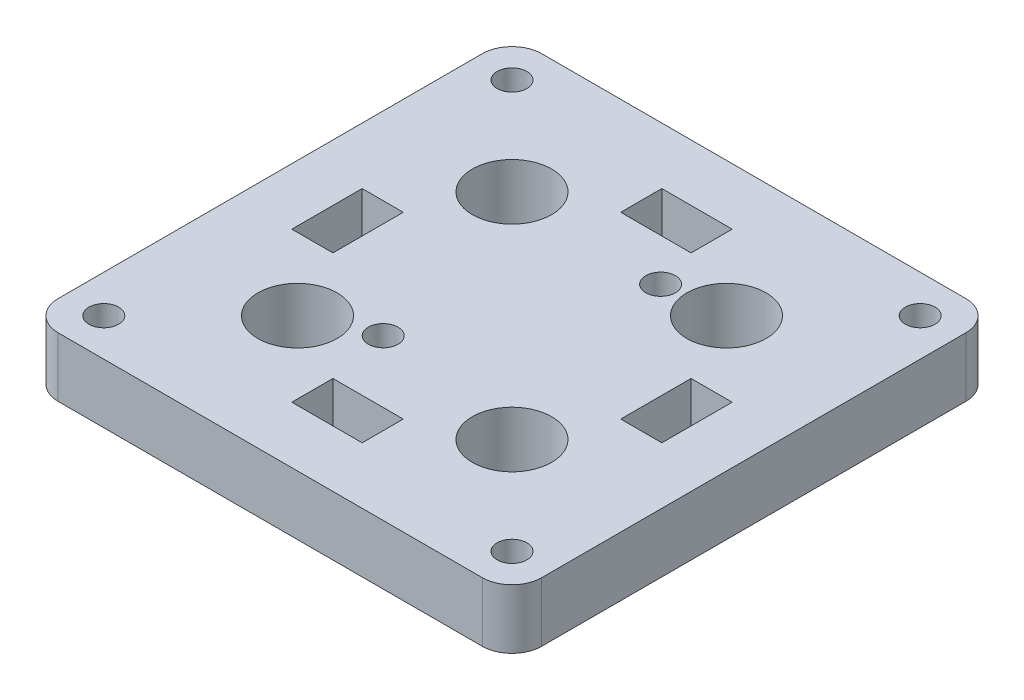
ISO-10303-21;
HEADER;
FILE_DESCRIPTION(('STEP AP214'),'2;1');
FILE_NAME('part.step','',(''),(''),'','','');
FILE_SCHEMA(('AUTOMOTIVE_DESIGN { 1 0 10303 214 1 1 1 1 }'));
ENDSEC;
DATA;
#1=APPLICATION_CONTEXT('core data for automotive mechanical design processes');
#2=APPLICATION_PROTOCOL_DEFINITION('international standard','automotive_design',2000,#1);
#3=PRODUCT_CONTEXT('',#1,'mechanical');
#4=PRODUCT('Part','Part','',(#3));
#5=PRODUCT_RELATED_PRODUCT_CATEGORY('part','',(#4));
#6=PRODUCT_DEFINITION_FORMATION('','',#4);
#7=PRODUCT_DEFINITION_CONTEXT('part definition',#1,'design');
#8=PRODUCT_DEFINITION('design','',#6,#7);
#9=PRODUCT_DEFINITION_SHAPE('','',#8);
#10=(LENGTH_UNIT() NAMED_UNIT(*) SI_UNIT(.MILLI.,.METRE.));
#11=(NAMED_UNIT(*) PLANE_ANGLE_UNIT() SI_UNIT($,.RADIAN.));
#12=(NAMED_UNIT(*) SI_UNIT($,.STERADIAN.) SOLID_ANGLE_UNIT());
#13=UNCERTAINTY_MEASURE_WITH_UNIT(LENGTH_MEASURE(1.E-05),#10,'distance_accuracy_value','');
#14=(GEOMETRIC_REPRESENTATION_CONTEXT(3) GLOBAL_UNCERTAINTY_ASSIGNED_CONTEXT((#13)) GLOBAL_UNIT_ASSIGNED_CONTEXT((#10,
#11,#12)) REPRESENTATION_CONTEXT('',''));
#15=CARTESIAN_POINT('',(0.,0.,0.));
#16=DIRECTION('',(0.,0.,1.));
#17=DIRECTION('',(1.,0.,0.));
#18=AXIS2_PLACEMENT_3D('',#15,#16,#17);
#19=CARTESIAN_POINT('',(0.,3.,0.));
#20=DIRECTION('',(0.,1.,0.));
#21=DIRECTION('',(0.,0.,1.));
#22=AXIS2_PLACEMENT_3D('',#19,#20,#21);
#23=PLANE('',#22);
#24=DIRECTION('',(1.,0.,0.));
#25=VECTOR('',#24,1.);
#26=CARTESIAN_POINT('',(-18.675,3.,-3.55));
#27=LINE('',#26,#25);
#28=CARTESIAN_POINT('',(-14.525,3.,-3.55));
#29=VERTEX_POINT('',#28);
#30=CARTESIAN_POINT('',(-18.675,3.,-3.55));
#31=VERTEX_POINT('',#30);
#32=EDGE_CURVE('E468',#29,#31,#27,.F.);
#33=ORIENTED_EDGE('',*,*,#32,.F.);
#34=DIRECTION('',(0.,0.,1.));
#35=VECTOR('',#34,1.);
#36=CARTESIAN_POINT('',(-14.525,3.,-3.55));
#37=LINE('',#36,#35);
#38=CARTESIAN_POINT('',(-14.525,3.,3.55));
#39=VERTEX_POINT('',#38);
#40=EDGE_CURVE('E449',#39,#29,#37,.F.);
#41=ORIENTED_EDGE('',*,*,#40,.F.);
#42=DIRECTION('',(-1.,0.,0.));
#43=VECTOR('',#42,1.);
#44=CARTESIAN_POINT('',(-14.525,3.,3.55));
#45=LINE('',#44,#43);
#46=CARTESIAN_POINT('',(-18.675,3.,3.55));
#47=VERTEX_POINT('',#46);
#48=EDGE_CURVE('E452',#47,#39,#45,.F.);
#49=ORIENTED_EDGE('',*,*,#48,.F.);
#50=DIRECTION('',(0.,0.,-1.));
#51=VECTOR('',#50,1.);
#52=CARTESIAN_POINT('',(-18.675,3.,3.55));
#53=LINE('',#52,#51);
#54=EDGE_CURVE('E458',#31,#47,#53,.F.);
#55=ORIENTED_EDGE('',*,*,#54,.F.);
#56=EDGE_LOOP('',(#33,#41,#49,#55));
#57=FACE_BOUND('',#56,.T.);
#58=DIRECTION('',(-1.,0.,0.));
#59=VECTOR('',#58,1.);
#60=CARTESIAN_POINT('',(3.55,3.,18.675));
#61=LINE('',#60,#59);
#62=CARTESIAN_POINT('',(-3.55,3.,18.675));
#63=VERTEX_POINT('',#62);
#64=CARTESIAN_POINT('',(3.55,3.,18.675));
#65=VERTEX_POINT('',#64);
#66=EDGE_CURVE('E443',#63,#65,#61,.F.);
#67=ORIENTED_EDGE('',*,*,#66,.F.);
#68=DIRECTION('',(0.,0.,-1.));
#69=VECTOR('',#68,1.);
#70=CARTESIAN_POINT('',(-3.55,3.,18.675));
#71=LINE('',#70,#69);
#72=CARTESIAN_POINT('',(-3.55,3.,14.525));
#73=VERTEX_POINT('',#72);
#74=EDGE_CURVE('E424',#73,#63,#71,.F.);
#75=ORIENTED_EDGE('',*,*,#74,.F.);
#76=DIRECTION('',(1.,0.,0.));
#77=VECTOR('',#76,1.);
#78=CARTESIAN_POINT('',(-3.55,3.,14.525));
#79=LINE('',#78,#77);
#80=CARTESIAN_POINT('',(3.55,3.,14.525));
#81=VERTEX_POINT('',#80);
#82=EDGE_CURVE('E427',#81,#73,#79,.F.);
#83=ORIENTED_EDGE('',*,*,#82,.F.);
#84=DIRECTION('',(0.,0.,1.));
#85=VECTOR('',#84,1.);
#86=CARTESIAN_POINT('',(3.55,3.,14.525));
#87=LINE('',#86,#85);
#88=EDGE_CURVE('E433',#65,#81,#87,.F.);
#89=ORIENTED_EDGE('',*,*,#88,.F.);
#90=EDGE_LOOP('',(#67,#75,#83,#89));
#91=FACE_BOUND('',#90,.T.);
#92=DIRECTION('',(0.,0.,-1.));
#93=VECTOR('',#92,1.);
#94=CARTESIAN_POINT('',(14.525,3.,3.55));
#95=LINE('',#94,#93);
#96=CARTESIAN_POINT('',(14.525,3.,-3.55));
#97=VERTEX_POINT('',#96);
#98=CARTESIAN_POINT('',(14.525,3.,3.55));
#99=VERTEX_POINT('',#98);
#100=EDGE_CURVE('E418',#97,#99,#95,.F.);
#101=ORIENTED_EDGE('',*,*,#100,.F.);
#102=DIRECTION('',(1.,0.,0.));
#103=VECTOR('',#102,1.);
#104=CARTESIAN_POINT('',(14.525,3.,-3.55));
#105=LINE('',#104,#103);
#106=CARTESIAN_POINT('',(18.675,3.,-3.55));
#107=VERTEX_POINT('',#106);
#108=EDGE_CURVE('E399',#107,#97,#105,.F.);
#109=ORIENTED_EDGE('',*,*,#108,.F.);
#110=DIRECTION('',(0.,0.,1.));
#111=VECTOR('',#110,1.);
#112=CARTESIAN_POINT('',(18.675,3.,-3.55));
#113=LINE('',#112,#111);
#114=CARTESIAN_POINT('',(18.675,3.,3.55));
#115=VERTEX_POINT('',#114);
#116=EDGE_CURVE('E402',#115,#107,#113,.F.);
#117=ORIENTED_EDGE('',*,*,#116,.F.);
#118=DIRECTION('',(-1.,0.,0.));
#119=VECTOR('',#118,1.);
#120=CARTESIAN_POINT('',(18.675,3.,3.55));
#121=LINE('',#120,#119);
#122=EDGE_CURVE('E408',#99,#115,#121,.F.);
#123=ORIENTED_EDGE('',*,*,#122,.F.);
#124=EDGE_LOOP('',(#101,#109,#117,#123));
#125=FACE_BOUND('',#124,.T.);
#126=DIRECTION('',(0.,0.,-1.));
#127=VECTOR('',#126,1.);
#128=CARTESIAN_POINT('',(-3.55,3.,-14.525));
#129=LINE('',#128,#127);
#130=CARTESIAN_POINT('',(-3.55,3.,-18.675));
#131=VERTEX_POINT('',#130);
#132=CARTESIAN_POINT('',(-3.55,3.,-14.525));
#133=VERTEX_POINT('',#132);
#134=EDGE_CURVE('E393',#131,#133,#129,.F.);
#135=ORIENTED_EDGE('',*,*,#134,.F.);
#136=DIRECTION('',(1.,0.,0.));
#137=VECTOR('',#136,1.);
#138=CARTESIAN_POINT('',(-3.55,3.,-18.675));
#139=LINE('',#138,#137);
#140=CARTESIAN_POINT('',(3.55,3.,-18.675));
#141=VERTEX_POINT('',#140);
#142=EDGE_CURVE('E315',#141,#131,#139,.F.);
#143=ORIENTED_EDGE('',*,*,#142,.F.);
#144=DIRECTION('',(0.,0.,1.));
#145=VECTOR('',#144,1.);
#146=CARTESIAN_POINT('',(3.55,3.,-18.675));
#147=LINE('',#146,#145);
#148=CARTESIAN_POINT('',(3.55,3.,-14.525));
#149=VERTEX_POINT('',#148);
#150=EDGE_CURVE('E377',#149,#141,#147,.F.);
#151=ORIENTED_EDGE('',*,*,#150,.F.);
#152=DIRECTION('',(-1.,0.,0.));
#153=VECTOR('',#152,1.);
#154=CARTESIAN_POINT('',(3.55,3.,-14.525));
#155=LINE('',#154,#153);
#156=EDGE_CURVE('E383',#133,#149,#155,.F.);
#157=ORIENTED_EDGE('',*,*,#156,.F.);
#158=EDGE_LOOP('',(#135,#143,#151,#157));
#159=FACE_BOUND('',#158,.T.);
#160=CARTESIAN_POINT('',(-4.75,3.,8.25));
#161=DIRECTION('',(0.,1.,0.));
#162=DIRECTION('',(0.,0.,1.));
#163=AXIS2_PLACEMENT_3D('',#160,#161,#162);
#164=CIRCLE('',#163,1.5);
#165=CARTESIAN_POINT('',(-4.75,3.,9.75));
#166=VERTEX_POINT('',#165);
#167=EDGE_CURVE('E311',#166,#166,#164,.F.);
#168=ORIENTED_EDGE('',*,*,#167,.T.);
#169=EDGE_LOOP('',(#168));
#170=FACE_BOUND('',#169,.T.);
#171=CARTESIAN_POINT('',(4.75,3.,-10.25));
#172=DIRECTION('',(0.,1.,0.));
#173=DIRECTION('',(0.,0.,1.));
#174=AXIS2_PLACEMENT_3D('',#171,#172,#173);
#175=CIRCLE('',#174,1.5);
#176=CARTESIAN_POINT('',(4.75,3.,-8.75));
#177=VERTEX_POINT('',#176);
#178=EDGE_CURVE('E316',#177,#177,#175,.F.);
#179=ORIENTED_EDGE('',*,*,#178,.T.);
#180=EDGE_LOOP('',(#179));
#181=FACE_BOUND('',#180,.T.);
#182=CARTESIAN_POINT('',(-10.825,3.,-10.825));
#183=DIRECTION('',(0.,1.,0.));
#184=DIRECTION('',(0.,0.,1.));
#185=AXIS2_PLACEMENT_3D('',#182,#183,#184);
#186=CIRCLE('',#185,4.);
#187=CARTESIAN_POINT('',(-10.825,3.,-6.825));
#188=VERTEX_POINT('',#187);
#189=EDGE_CURVE('E320',#188,#188,#186,.F.);
#190=ORIENTED_EDGE('',*,*,#189,.T.);
#191=EDGE_LOOP('',(#190));
#192=FACE_BOUND('',#191,.T.);
#193=CARTESIAN_POINT('',(10.825,3.,-10.825));
#194=DIRECTION('',(0.,1.,0.));
#195=DIRECTION('',(0.,0.,1.));
#196=AXIS2_PLACEMENT_3D('',#193,#194,#195);
#197=CIRCLE('',#196,4.);
#198=CARTESIAN_POINT('',(10.825,3.,-6.825));
#199=VERTEX_POINT('',#198);
#200=EDGE_CURVE('E324',#199,#199,#197,.F.);
#201=ORIENTED_EDGE('',*,*,#200,.T.);
#202=EDGE_LOOP('',(#201));
#203=FACE_BOUND('',#202,.T.);
#204=CARTESIAN_POINT('',(10.825,3.,10.825));
#205=DIRECTION('',(0.,1.,0.));
#206=DIRECTION('',(0.,0.,1.));
#207=AXIS2_PLACEMENT_3D('',#204,#205,#206);
#208=CIRCLE('',#207,4.);
#209=CARTESIAN_POINT('',(10.825,3.,14.825));
#210=VERTEX_POINT('',#209);
#211=EDGE_CURVE('E328',#210,#210,#208,.F.);
#212=ORIENTED_EDGE('',*,*,#211,.T.);
#213=EDGE_LOOP('',(#212));
#214=FACE_BOUND('',#213,.T.);
#215=CARTESIAN_POINT('',(-10.825,3.,10.825));
#216=DIRECTION('',(0.,1.,0.));
#217=DIRECTION('',(0.,0.,1.));
#218=AXIS2_PLACEMENT_3D('',#215,#216,#217);
#219=CIRCLE('',#218,4.);
#220=CARTESIAN_POINT('',(-10.825,3.,14.825));
#221=VERTEX_POINT('',#220);
#222=EDGE_CURVE('E332',#221,#221,#219,.F.);
#223=ORIENTED_EDGE('',*,*,#222,.T.);
#224=EDGE_LOOP('',(#223));
#225=FACE_BOUND('',#224,.T.);
#226=CARTESIAN_POINT('',(-20.6,3.,-20.6));
#227=DIRECTION('',(0.,1.,0.));
#228=DIRECTION('',(0.,0.,1.));
#229=AXIS2_PLACEMENT_3D('',#226,#227,#228);
#230=CIRCLE('',#229,1.5);
#231=CARTESIAN_POINT('',(-20.6,3.,-19.1));
#232=VERTEX_POINT('',#231);
#233=EDGE_CURVE('E336',#232,#232,#230,.F.);
#234=ORIENTED_EDGE('',*,*,#233,.T.);
#235=EDGE_LOOP('',(#234));
#236=FACE_BOUND('',#235,.T.);
#237=CARTESIAN_POINT('',(-20.6,3.,20.6));
#238=DIRECTION('',(0.,1.,0.));
#239=DIRECTION('',(0.,0.,1.));
#240=AXIS2_PLACEMENT_3D('',#237,#238,#239);
#241=CIRCLE('',#240,1.5);
#242=CARTESIAN_POINT('',(-20.6,3.,22.1));
#243=VERTEX_POINT('',#242);
#244=EDGE_CURVE('E340',#243,#243,#241,.F.);
#245=ORIENTED_EDGE('',*,*,#244,.T.);
#246=EDGE_LOOP('',(#245));
#247=FACE_BOUND('',#246,.T.);
#248=CARTESIAN_POINT('',(20.6,3.,20.6));
#249=DIRECTION('',(0.,1.,0.));
#250=DIRECTION('',(0.,0.,1.));
#251=AXIS2_PLACEMENT_3D('',#248,#249,#250);
#252=CIRCLE('',#251,1.5);
#253=CARTESIAN_POINT('',(20.6,3.,22.1));
#254=VERTEX_POINT('',#253);
#255=EDGE_CURVE('E344',#254,#254,#252,.F.);
#256=ORIENTED_EDGE('',*,*,#255,.T.);
#257=EDGE_LOOP('',(#256));
#258=FACE_BOUND('',#257,.T.);
#259=CARTESIAN_POINT('',(20.6,3.,-20.6));
#260=DIRECTION('',(0.,1.,0.));
#261=DIRECTION('',(0.,0.,1.));
#262=AXIS2_PLACEMENT_3D('',#259,#260,#261);
#263=CIRCLE('',#262,1.5);
#264=CARTESIAN_POINT('',(20.6,3.,-19.1));
#265=VERTEX_POINT('',#264);
#266=EDGE_CURVE('E348',#265,#265,#263,.F.);
#267=ORIENTED_EDGE('',*,*,#266,.T.);
#268=EDGE_LOOP('',(#267));
#269=FACE_BOUND('',#268,.T.);
#270=DIRECTION('',(-1.,0.,0.));
#271=VECTOR('',#270,1.);
#272=CARTESIAN_POINT('',(21.4,3.,-24.4));
#273=LINE('',#272,#271);
#274=CARTESIAN_POINT('',(-21.4,3.,-24.4));
#275=VERTEX_POINT('',#274);
#276=CARTESIAN_POINT('',(21.4,3.,-24.4));
#277=VERTEX_POINT('',#276);
#278=EDGE_CURVE('E231',#275,#277,#273,.F.);
#279=ORIENTED_EDGE('',*,*,#278,.F.);
#280=CARTESIAN_POINT('',(-21.4,3.,-21.4));
#281=DIRECTION('',(0.,1.,0.));
#282=DIRECTION('',(0.,0.,1.));
#283=AXIS2_PLACEMENT_3D('',#280,#281,#282);
#284=CIRCLE('',#283,3.);
#285=CARTESIAN_POINT('',(-24.4,3.,-21.4));
#286=VERTEX_POINT('',#285);
#287=EDGE_CURVE('E20',#286,#275,#284,.F.);
#288=ORIENTED_EDGE('',*,*,#287,.F.);
#289=DIRECTION('',(0.,0.,1.));
#290=VECTOR('',#289,1.);
#291=CARTESIAN_POINT('',(-24.4,3.,-21.4));
#292=LINE('',#291,#290);
#293=CARTESIAN_POINT('',(-24.4,3.,21.4));
#294=VERTEX_POINT('',#293);
#295=EDGE_CURVE('E216',#294,#286,#292,.F.);
#296=ORIENTED_EDGE('',*,*,#295,.F.);
#297=CARTESIAN_POINT('',(-21.4,3.,21.4));
#298=DIRECTION('',(0.,1.,0.));
#299=DIRECTION('',(0.,0.,1.));
#300=AXIS2_PLACEMENT_3D('',#297,#298,#299);
#301=CIRCLE('',#300,3.);
#302=CARTESIAN_POINT('',(-21.4,3.,24.4));
#303=VERTEX_POINT('',#302);
#304=EDGE_CURVE('E238',#303,#294,#301,.F.);
#305=ORIENTED_EDGE('',*,*,#304,.F.);
#306=DIRECTION('',(1.,0.,0.));
#307=VECTOR('',#306,1.);
#308=CARTESIAN_POINT('',(-21.4,3.,24.4));
#309=LINE('',#308,#307);
#310=CARTESIAN_POINT('',(21.4,3.,24.4));
#311=VERTEX_POINT('',#310);
#312=EDGE_CURVE('E252',#311,#303,#309,.F.);
#313=ORIENTED_EDGE('',*,*,#312,.F.);
#314=CARTESIAN_POINT('',(21.4,3.,21.4));
#315=DIRECTION('',(0.,1.,0.));
#316=DIRECTION('',(0.,0.,1.));
#317=AXIS2_PLACEMENT_3D('',#314,#315,#316);
#318=CIRCLE('',#317,3.);
#319=CARTESIAN_POINT('',(24.4,3.,21.4));
#320=VERTEX_POINT('',#319);
#321=EDGE_CURVE('E354',#320,#311,#318,.F.);
#322=ORIENTED_EDGE('',*,*,#321,.F.);
#323=DIRECTION('',(0.,0.,-1.));
#324=VECTOR('',#323,1.);
#325=CARTESIAN_POINT('',(24.4,3.,21.4));
#326=LINE('',#325,#324);
#327=CARTESIAN_POINT('',(24.4,3.,-21.4));
#328=VERTEX_POINT('',#327);
#329=EDGE_CURVE('E247',#328,#320,#326,.F.);
#330=ORIENTED_EDGE('',*,*,#329,.F.);
#331=CARTESIAN_POINT('',(21.4,3.,-21.4));
#332=DIRECTION('',(0.,1.,0.));
#333=DIRECTION('',(0.,0.,1.));
#334=AXIS2_PLACEMENT_3D('',#331,#332,#333);
#335=CIRCLE('',#334,3.);
#336=EDGE_CURVE('E351',#277,#328,#335,.F.);
#337=ORIENTED_EDGE('',*,*,#336,.F.);
#338=EDGE_LOOP('',(#279,#288,#296,#305,#313,#322,#330,#337));
#339=FACE_BOUND('',#338,.T.);
#340=ADVANCED_FACE('F17',(#57,#91,#125,#159,#170,#181,#192,#203,#214,#225,#236,#247,#258,#269,
#339),#23,.T.);
#341=CARTESIAN_POINT('',(-21.4,-3.,-21.4));
#342=DIRECTION('',(0.,1.,0.));
#343=DIRECTION('',(0.,0.,1.));
#344=AXIS2_PLACEMENT_3D('',#341,#342,#343);
#345=CYLINDRICAL_SURFACE('',#344,3.);
#346=DIRECTION('',(0.,1.,0.));
#347=VECTOR('',#346,1.);
#348=CARTESIAN_POINT('',(-21.4,-3.,-24.4));
#349=LINE('',#348,#347);
#350=CARTESIAN_POINT('',(-21.4,-3.,-24.4));
#351=VERTEX_POINT('',#350);
#352=EDGE_CURVE('E246',#351,#275,#349,.T.);
#353=ORIENTED_EDGE('',*,*,#352,.F.);
#354=CARTESIAN_POINT('',(-21.4,-3.,-21.4));
#355=DIRECTION('',(0.,1.,0.));
#356=DIRECTION('',(0.,0.,1.));
#357=AXIS2_PLACEMENT_3D('',#354,#355,#356);
#358=CIRCLE('',#357,3.);
#359=CARTESIAN_POINT('',(-24.4,-3.,-21.4));
#360=VERTEX_POINT('',#359);
#361=EDGE_CURVE('E237',#351,#360,#358,.T.);
#362=ORIENTED_EDGE('',*,*,#361,.T.);
#363=DIRECTION('',(0.,1.,0.));
#364=VECTOR('',#363,1.);
#365=CARTESIAN_POINT('',(-24.4,-3.,-21.4));
#366=LINE('',#365,#364);
#367=EDGE_CURVE('E221',#286,#360,#366,.F.);
#368=ORIENTED_EDGE('',*,*,#367,.F.);
#369=ORIENTED_EDGE('',*,*,#287,.T.);
#370=EDGE_LOOP('',(#353,#362,#368,#369));
#371=FACE_BOUND('',#370,.T.);
#372=ADVANCED_FACE('F236',(#371),#345,.T.);
#373=CARTESIAN_POINT('',(-24.4,-3.,-21.4));
#374=DIRECTION('',(-1.,0.,0.));
#375=DIRECTION('',(0.,0.,1.));
#376=AXIS2_PLACEMENT_3D('',#373,#374,#375);
#377=PLANE('',#376);
#378=ORIENTED_EDGE('',*,*,#367,.T.);
#379=DIRECTION('',(0.,0.,1.));
#380=VECTOR('',#379,1.);
#381=CARTESIAN_POINT('',(-24.4,-3.,0.));
#382=LINE('',#381,#380);
#383=CARTESIAN_POINT('',(-24.4,-3.,21.4));
#384=VERTEX_POINT('',#383);
#385=EDGE_CURVE('E309',#360,#384,#382,.T.);
#386=ORIENTED_EDGE('',*,*,#385,.T.);
#387=DIRECTION('',(0.,1.,0.));
#388=VECTOR('',#387,1.);
#389=CARTESIAN_POINT('',(-24.4,-3.,21.4));
#390=LINE('',#389,#388);
#391=EDGE_CURVE('E223',#294,#384,#390,.F.);
#392=ORIENTED_EDGE('',*,*,#391,.F.);
#393=ORIENTED_EDGE('',*,*,#295,.T.);
#394=EDGE_LOOP('',(#378,#386,#392,#393));
#395=FACE_BOUND('',#394,.T.);
#396=ADVANCED_FACE('F218',(#395),#377,.T.);
#397=CARTESIAN_POINT('',(-21.4,-3.,21.4));
#398=DIRECTION('',(0.,1.,0.));
#399=DIRECTION('',(0.,0.,1.));
#400=AXIS2_PLACEMENT_3D('',#397,#398,#399);
#401=CYLINDRICAL_SURFACE('',#400,3.);
#402=ORIENTED_EDGE('',*,*,#391,.T.);
#403=CARTESIAN_POINT('',(-21.4,-3.,21.4));
#404=DIRECTION('',(0.,1.,0.));
#405=DIRECTION('',(0.,0.,1.));
#406=AXIS2_PLACEMENT_3D('',#403,#404,#405);
#407=CIRCLE('',#406,3.);
#408=CARTESIAN_POINT('',(-21.4,-3.,24.4));
#409=VERTEX_POINT('',#408);
#410=EDGE_CURVE('E305',#384,#409,#407,.T.);
#411=ORIENTED_EDGE('',*,*,#410,.T.);
#412=DIRECTION('',(0.,1.,0.));
#413=VECTOR('',#412,1.);
#414=CARTESIAN_POINT('',(-21.4,-3.,24.4));
#415=LINE('',#414,#413);
#416=EDGE_CURVE('E254',#303,#409,#415,.F.);
#417=ORIENTED_EDGE('',*,*,#416,.F.);
#418=ORIENTED_EDGE('',*,*,#304,.T.);
#419=EDGE_LOOP('',(#402,#411,#417,#418));
#420=FACE_BOUND('',#419,.T.);
#421=ADVANCED_FACE('F678',(#420),#401,.T.);
#422=CARTESIAN_POINT('',(-21.4,-3.,24.4));
#423=DIRECTION('',(0.,0.,1.));
#424=DIRECTION('',(1.,0.,0.));
#425=AXIS2_PLACEMENT_3D('',#422,#423,#424);
#426=PLANE('',#425);
#427=ORIENTED_EDGE('',*,*,#416,.T.);
#428=DIRECTION('',(1.,0.,0.));
#429=VECTOR('',#428,1.);
#430=CARTESIAN_POINT('',(0.,-3.,24.4));
#431=LINE('',#430,#429);
#432=CARTESIAN_POINT('',(21.4,-3.,24.4));
#433=VERTEX_POINT('',#432);
#434=EDGE_CURVE('E304',#409,#433,#431,.T.);
#435=ORIENTED_EDGE('',*,*,#434,.T.);
#436=DIRECTION('',(0.,1.,0.));
#437=VECTOR('',#436,1.);
#438=CARTESIAN_POINT('',(21.4,-3.,24.4));
#439=LINE('',#438,#437);
#440=EDGE_CURVE('E251',#311,#433,#439,.F.);
#441=ORIENTED_EDGE('',*,*,#440,.F.);
#442=ORIENTED_EDGE('',*,*,#312,.T.);
#443=EDGE_LOOP('',(#427,#435,#441,#442));
#444=FACE_BOUND('',#443,.T.);
#445=ADVANCED_FACE('F675',(#444),#426,.T.);
#446=CARTESIAN_POINT('',(21.4,-3.,21.4));
#447=DIRECTION('',(0.,1.,0.));
#448=DIRECTION('',(0.,0.,1.));
#449=AXIS2_PLACEMENT_3D('',#446,#447,#448);
#450=CYLINDRICAL_SURFACE('',#449,3.);
#451=ORIENTED_EDGE('',*,*,#440,.T.);
#452=CARTESIAN_POINT('',(21.4,-3.,21.4));
#453=DIRECTION('',(0.,1.,0.));
#454=DIRECTION('',(0.,0.,1.));
#455=AXIS2_PLACEMENT_3D('',#452,#453,#454);
#456=CIRCLE('',#455,3.);
#457=CARTESIAN_POINT('',(24.4,-3.,21.4));
#458=VERTEX_POINT('',#457);
#459=EDGE_CURVE('E300',#433,#458,#456,.T.);
#460=ORIENTED_EDGE('',*,*,#459,.T.);
#461=DIRECTION('',(0.,1.,0.));
#462=VECTOR('',#461,1.);
#463=CARTESIAN_POINT('',(24.4,-3.,21.4));
#464=LINE('',#463,#462);
#465=EDGE_CURVE('E250',#320,#458,#464,.F.);
#466=ORIENTED_EDGE('',*,*,#465,.F.);
#467=ORIENTED_EDGE('',*,*,#321,.T.);
#468=EDGE_LOOP('',(#451,#460,#466,#467));
#469=FACE_BOUND('',#468,.T.);
#470=ADVANCED_FACE('F671',(#469),#450,.T.);
#471=CARTESIAN_POINT('',(24.4,-3.,21.4));
#472=DIRECTION('',(1.,0.,0.));
#473=DIRECTION('',(0.,0.,-1.));
#474=AXIS2_PLACEMENT_3D('',#471,#472,#473);
#475=PLANE('',#474);
#476=ORIENTED_EDGE('',*,*,#465,.T.);
#477=DIRECTION('',(0.,0.,1.));
#478=VECTOR('',#477,1.);
#479=CARTESIAN_POINT('',(24.4,-3.,0.));
#480=LINE('',#479,#478);
#481=CARTESIAN_POINT('',(24.4,-3.,-21.4));
#482=VERTEX_POINT('',#481);
#483=EDGE_CURVE('E299',#458,#482,#480,.F.);
#484=ORIENTED_EDGE('',*,*,#483,.T.);
#485=DIRECTION('',(0.,1.,0.));
#486=VECTOR('',#485,1.);
#487=CARTESIAN_POINT('',(24.4,-3.,-21.4));
#488=LINE('',#487,#486);
#489=EDGE_CURVE('E353',#328,#482,#488,.F.);
#490=ORIENTED_EDGE('',*,*,#489,.F.);
#491=ORIENTED_EDGE('',*,*,#329,.T.);
#492=EDGE_LOOP('',(#476,#484,#490,#491));
#493=FACE_BOUND('',#492,.T.);
#494=ADVANCED_FACE('F667',(#493),#475,.T.);
#495=CARTESIAN_POINT('',(21.4,-3.,-21.4));
#496=DIRECTION('',(0.,1.,0.));
#497=DIRECTION('',(0.,0.,1.));
#498=AXIS2_PLACEMENT_3D('',#495,#496,#497);
#499=CYLINDRICAL_SURFACE('',#498,3.);
#500=ORIENTED_EDGE('',*,*,#489,.T.);
#501=CARTESIAN_POINT('',(21.4,-3.,-21.4));
#502=DIRECTION('',(0.,1.,0.));
#503=DIRECTION('',(0.,0.,1.));
#504=AXIS2_PLACEMENT_3D('',#501,#502,#503);
#505=CIRCLE('',#504,3.);
#506=CARTESIAN_POINT('',(21.4,-3.,-24.4));
#507=VERTEX_POINT('',#506);
#508=EDGE_CURVE('E296',#482,#507,#505,.T.);
#509=ORIENTED_EDGE('',*,*,#508,.T.);
#510=DIRECTION('',(0.,1.,0.));
#511=VECTOR('',#510,1.);
#512=CARTESIAN_POINT('',(21.4,-3.,-24.4));
#513=LINE('',#512,#511);
#514=EDGE_CURVE('E245',#277,#507,#513,.F.);
#515=ORIENTED_EDGE('',*,*,#514,.F.);
#516=ORIENTED_EDGE('',*,*,#336,.T.);
#517=EDGE_LOOP('',(#500,#509,#515,#516));
#518=FACE_BOUND('',#517,.T.);
#519=ADVANCED_FACE('F663',(#518),#499,.T.);
#520=CARTESIAN_POINT('',(21.4,-3.,-24.4));
#521=DIRECTION('',(0.,0.,-1.));
#522=DIRECTION('',(-1.,0.,0.));
#523=AXIS2_PLACEMENT_3D('',#520,#521,#522);
#524=PLANE('',#523);
#525=ORIENTED_EDGE('',*,*,#514,.T.);
#526=DIRECTION('',(1.,0.,0.));
#527=VECTOR('',#526,1.);
#528=CARTESIAN_POINT('',(0.,-3.,-24.4));
#529=LINE('',#528,#527);
#530=EDGE_CURVE('E295',#507,#351,#529,.F.);
#531=ORIENTED_EDGE('',*,*,#530,.T.);
#532=ORIENTED_EDGE('',*,*,#352,.T.);
#533=ORIENTED_EDGE('',*,*,#278,.T.);
#534=EDGE_LOOP('',(#525,#531,#532,#533));
#535=FACE_BOUND('',#534,.T.);
#536=ADVANCED_FACE('F659',(#535),#524,.T.);
#537=CARTESIAN_POINT('',(20.6,-3.,-20.6));
#538=DIRECTION('',(0.,1.,0.));
#539=DIRECTION('',(0.,0.,1.));
#540=AXIS2_PLACEMENT_3D('',#537,#538,#539);
#541=CYLINDRICAL_SURFACE('',#540,1.5);
#542=ORIENTED_EDGE('',*,*,#266,.F.);
#543=EDGE_LOOP('',(#542));
#544=FACE_BOUND('',#543,.T.);
#545=CARTESIAN_POINT('',(20.6,-3.,-20.6));
#546=DIRECTION('',(0.,1.,0.));
#547=DIRECTION('',(0.,0.,1.));
#548=AXIS2_PLACEMENT_3D('',#545,#546,#547);
#549=CIRCLE('',#548,1.5);
#550=CARTESIAN_POINT('',(20.6,-3.,-19.1));
#551=VERTEX_POINT('',#550);
#552=EDGE_CURVE('E292',#551,#551,#549,.F.);
#553=ORIENTED_EDGE('',*,*,#552,.T.);
#554=EDGE_LOOP('',(#553));
#555=FACE_BOUND('',#554,.T.);
#556=ADVANCED_FACE('F655',(#544,#555),#541,.F.);
#557=CARTESIAN_POINT('',(20.6,-3.,20.6));
#558=DIRECTION('',(0.,1.,0.));
#559=DIRECTION('',(0.,0.,1.));
#560=AXIS2_PLACEMENT_3D('',#557,#558,#559);
#561=CYLINDRICAL_SURFACE('',#560,1.5);
#562=ORIENTED_EDGE('',*,*,#255,.F.);
#563=EDGE_LOOP('',(#562));
#564=FACE_BOUND('',#563,.T.);
#565=CARTESIAN_POINT('',(20.6,-3.,20.6));
#566=DIRECTION('',(0.,1.,0.));
#567=DIRECTION('',(0.,0.,1.));
#568=AXIS2_PLACEMENT_3D('',#565,#566,#567);
#569=CIRCLE('',#568,1.5);
#570=CARTESIAN_POINT('',(20.6,-3.,22.1));
#571=VERTEX_POINT('',#570);
#572=EDGE_CURVE('E288',#571,#571,#569,.F.);
#573=ORIENTED_EDGE('',*,*,#572,.T.);
#574=EDGE_LOOP('',(#573));
#575=FACE_BOUND('',#574,.T.);
#576=ADVANCED_FACE('F651',(#564,#575),#561,.F.);
#577=CARTESIAN_POINT('',(-20.6,-3.,20.6));
#578=DIRECTION('',(0.,1.,0.));
#579=DIRECTION('',(0.,0.,1.));
#580=AXIS2_PLACEMENT_3D('',#577,#578,#579);
#581=CYLINDRICAL_SURFACE('',#580,1.5);
#582=ORIENTED_EDGE('',*,*,#244,.F.);
#583=EDGE_LOOP('',(#582));
#584=FACE_BOUND('',#583,.T.);
#585=CARTESIAN_POINT('',(-20.6,-3.,20.6));
#586=DIRECTION('',(0.,1.,0.));
#587=DIRECTION('',(0.,0.,1.));
#588=AXIS2_PLACEMENT_3D('',#585,#586,#587);
#589=CIRCLE('',#588,1.5);
#590=CARTESIAN_POINT('',(-20.6,-3.,22.1));
#591=VERTEX_POINT('',#590);
#592=EDGE_CURVE('E284',#591,#591,#589,.F.);
#593=ORIENTED_EDGE('',*,*,#592,.T.);
#594=EDGE_LOOP('',(#593));
#595=FACE_BOUND('',#594,.T.);
#596=ADVANCED_FACE('F647',(#584,#595),#581,.F.);
#597=CARTESIAN_POINT('',(-20.6,-3.,-20.6));
#598=DIRECTION('',(0.,1.,0.));
#599=DIRECTION('',(0.,0.,1.));
#600=AXIS2_PLACEMENT_3D('',#597,#598,#599);
#601=CYLINDRICAL_SURFACE('',#600,1.5);
#602=ORIENTED_EDGE('',*,*,#233,.F.);
#603=EDGE_LOOP('',(#602));
#604=FACE_BOUND('',#603,.T.);
#605=CARTESIAN_POINT('',(-20.6,-3.,-20.6));
#606=DIRECTION('',(0.,1.,0.));
#607=DIRECTION('',(0.,0.,1.));
#608=AXIS2_PLACEMENT_3D('',#605,#606,#607);
#609=CIRCLE('',#608,1.5);
#610=CARTESIAN_POINT('',(-20.6,-3.,-19.1));
#611=VERTEX_POINT('',#610);
#612=EDGE_CURVE('E281',#611,#611,#609,.F.);
#613=ORIENTED_EDGE('',*,*,#612,.T.);
#614=EDGE_LOOP('',(#613));
#615=FACE_BOUND('',#614,.T.);
#616=ADVANCED_FACE('F643',(#604,#615),#601,.F.);
#617=CARTESIAN_POINT('',(-10.825,-3.,10.825));
#618=DIRECTION('',(0.,1.,0.));
#619=DIRECTION('',(0.,0.,1.));
#620=AXIS2_PLACEMENT_3D('',#617,#618,#619);
#621=CYLINDRICAL_SURFACE('',#620,4.);
#622=ORIENTED_EDGE('',*,*,#222,.F.);
#623=EDGE_LOOP('',(#622));
#624=FACE_BOUND('',#623,.T.);
#625=CARTESIAN_POINT('',(-10.825,-3.,10.825));
#626=DIRECTION('',(0.,1.,0.));
#627=DIRECTION('',(0.,0.,1.));
#628=AXIS2_PLACEMENT_3D('',#625,#626,#627);
#629=CIRCLE('',#628,4.);
#630=CARTESIAN_POINT('',(-10.825,-3.,14.825));
#631=VERTEX_POINT('',#630);
#632=EDGE_CURVE('E277',#631,#631,#629,.F.);
#633=ORIENTED_EDGE('',*,*,#632,.T.);
#634=EDGE_LOOP('',(#633));
#635=FACE_BOUND('',#634,.T.);
#636=ADVANCED_FACE('F639',(#624,#635),#621,.F.);
#637=CARTESIAN_POINT('',(10.825,-3.,10.825));
#638=DIRECTION('',(0.,1.,0.));
#639=DIRECTION('',(0.,0.,1.));
#640=AXIS2_PLACEMENT_3D('',#637,#638,#639);
#641=CYLINDRICAL_SURFACE('',#640,4.);
#642=ORIENTED_EDGE('',*,*,#211,.F.);
#643=EDGE_LOOP('',(#642));
#644=FACE_BOUND('',#643,.T.);
#645=CARTESIAN_POINT('',(10.825,-3.,10.825));
#646=DIRECTION('',(0.,1.,0.));
#647=DIRECTION('',(0.,0.,1.));
#648=AXIS2_PLACEMENT_3D('',#645,#646,#647);
#649=CIRCLE('',#648,4.);
#650=CARTESIAN_POINT('',(10.825,-3.,14.825));
#651=VERTEX_POINT('',#650);
#652=EDGE_CURVE('E273',#651,#651,#649,.F.);
#653=ORIENTED_EDGE('',*,*,#652,.T.);
#654=EDGE_LOOP('',(#653));
#655=FACE_BOUND('',#654,.T.);
#656=ADVANCED_FACE('F635',(#644,#655),#641,.F.);
#657=CARTESIAN_POINT('',(10.825,-3.,-10.825));
#658=DIRECTION('',(0.,1.,0.));
#659=DIRECTION('',(0.,0.,1.));
#660=AXIS2_PLACEMENT_3D('',#657,#658,#659);
#661=CYLINDRICAL_SURFACE('',#660,4.);
#662=ORIENTED_EDGE('',*,*,#200,.F.);
#663=EDGE_LOOP('',(#662));
#664=FACE_BOUND('',#663,.T.);
#665=CARTESIAN_POINT('',(10.825,-3.,-10.825));
#666=DIRECTION('',(0.,1.,0.));
#667=DIRECTION('',(0.,0.,1.));
#668=AXIS2_PLACEMENT_3D('',#665,#666,#667);
#669=CIRCLE('',#668,4.);
#670=CARTESIAN_POINT('',(10.825,-3.,-6.825));
#671=VERTEX_POINT('',#670);
#672=EDGE_CURVE('E269',#671,#671,#669,.F.);
#673=ORIENTED_EDGE('',*,*,#672,.T.);
#674=EDGE_LOOP('',(#673));
#675=FACE_BOUND('',#674,.T.);
#676=ADVANCED_FACE('F631',(#664,#675),#661,.F.);
#677=CARTESIAN_POINT('',(-10.825,-3.,-10.825));
#678=DIRECTION('',(0.,1.,0.));
#679=DIRECTION('',(0.,0.,1.));
#680=AXIS2_PLACEMENT_3D('',#677,#678,#679);
#681=CYLINDRICAL_SURFACE('',#680,4.);
#682=ORIENTED_EDGE('',*,*,#189,.F.);
#683=EDGE_LOOP('',(#682));
#684=FACE_BOUND('',#683,.T.);
#685=CARTESIAN_POINT('',(-10.825,-3.,-10.825));
#686=DIRECTION('',(0.,1.,0.));
#687=DIRECTION('',(0.,0.,1.));
#688=AXIS2_PLACEMENT_3D('',#685,#686,#687);
#689=CIRCLE('',#688,4.);
#690=CARTESIAN_POINT('',(-10.825,-3.,-6.825));
#691=VERTEX_POINT('',#690);
#692=EDGE_CURVE('E265',#691,#691,#689,.F.);
#693=ORIENTED_EDGE('',*,*,#692,.T.);
#694=EDGE_LOOP('',(#693));
#695=FACE_BOUND('',#694,.T.);
#696=ADVANCED_FACE('F627',(#684,#695),#681,.F.);
#697=CARTESIAN_POINT('',(4.75,-3.,-10.25));
#698=DIRECTION('',(0.,1.,0.));
#699=DIRECTION('',(0.,0.,1.));
#700=AXIS2_PLACEMENT_3D('',#697,#698,#699);
#701=CYLINDRICAL_SURFACE('',#700,1.5);
#702=ORIENTED_EDGE('',*,*,#178,.F.);
#703=EDGE_LOOP('',(#702));
#704=FACE_BOUND('',#703,.T.);
#705=CARTESIAN_POINT('',(4.75,-3.,-10.25));
#706=DIRECTION('',(0.,1.,0.));
#707=DIRECTION('',(0.,0.,1.));
#708=AXIS2_PLACEMENT_3D('',#705,#706,#707);
#709=CIRCLE('',#708,1.5);
#710=CARTESIAN_POINT('',(4.75,-3.,-8.75));
#711=VERTEX_POINT('',#710);
#712=EDGE_CURVE('E261',#711,#711,#709,.F.);
#713=ORIENTED_EDGE('',*,*,#712,.T.);
#714=EDGE_LOOP('',(#713));
#715=FACE_BOUND('',#714,.T.);
#716=ADVANCED_FACE('F623',(#704,#715),#701,.F.);
#717=CARTESIAN_POINT('',(-4.75,-3.,8.25));
#718=DIRECTION('',(0.,1.,0.));
#719=DIRECTION('',(0.,0.,1.));
#720=AXIS2_PLACEMENT_3D('',#717,#718,#719);
#721=CYLINDRICAL_SURFACE('',#720,1.5);
#722=ORIENTED_EDGE('',*,*,#167,.F.);
#723=EDGE_LOOP('',(#722));
#724=FACE_BOUND('',#723,.T.);
#725=CARTESIAN_POINT('',(-4.75,-3.,8.25));
#726=DIRECTION('',(0.,1.,0.));
#727=DIRECTION('',(0.,0.,1.));
#728=AXIS2_PLACEMENT_3D('',#725,#726,#727);
#729=CIRCLE('',#728,1.5);
#730=CARTESIAN_POINT('',(-4.75,-3.,9.75));
#731=VERTEX_POINT('',#730);
#732=EDGE_CURVE('E256',#731,#731,#729,.F.);
#733=ORIENTED_EDGE('',*,*,#732,.T.);
#734=EDGE_LOOP('',(#733));
#735=FACE_BOUND('',#734,.T.);
#736=ADVANCED_FACE('F619',(#724,#735),#721,.F.);
#737=CARTESIAN_POINT('',(-3.55,-3.,-18.675));
#738=DIRECTION('',(0.,0.,1.));
#739=DIRECTION('',(1.,0.,0.));
#740=AXIS2_PLACEMENT_3D('',#737,#738,#739);
#741=PLANE('',#740);
#742=DIRECTION('',(0.,1.,0.));
#743=VECTOR('',#742,1.);
#744=CARTESIAN_POINT('',(-3.55,-3.,-18.675));
#745=LINE('',#744,#743);
#746=CARTESIAN_POINT('',(-3.55,-3.,-18.675));
#747=VERTEX_POINT('',#746);
#748=EDGE_CURVE('E389',#747,#131,#745,.T.);
#749=ORIENTED_EDGE('',*,*,#748,.F.);
#750=DIRECTION('',(1.,0.,0.));
#751=VECTOR('',#750,1.);
#752=CARTESIAN_POINT('',(0.,-3.,-18.675));
#753=LINE('',#752,#751);
#754=CARTESIAN_POINT('',(3.55,-3.,-18.675));
#755=VERTEX_POINT('',#754);
#756=EDGE_CURVE('E260',#747,#755,#753,.T.);
#757=ORIENTED_EDGE('',*,*,#756,.T.);
#758=DIRECTION('',(0.,1.,0.));
#759=VECTOR('',#758,1.);
#760=CARTESIAN_POINT('',(3.55,-3.,-18.675));
#761=LINE('',#760,#759);
#762=EDGE_CURVE('E380',#141,#755,#761,.F.);
#763=ORIENTED_EDGE('',*,*,#762,.F.);
#764=ORIENTED_EDGE('',*,*,#142,.T.);
#765=EDGE_LOOP('',(#749,#757,#763,#764));
#766=FACE_BOUND('',#765,.T.);
#767=ADVANCED_FACE('F615',(#766),#741,.T.);
#768=CARTESIAN_POINT('',(3.55,-3.,-18.675));
#769=DIRECTION('',(-1.,0.,0.));
#770=DIRECTION('',(0.,0.,1.));
#771=AXIS2_PLACEMENT_3D('',#768,#769,#770);
#772=PLANE('',#771);
#773=ORIENTED_EDGE('',*,*,#762,.T.);
#774=DIRECTION('',(0.,0.,1.));
#775=VECTOR('',#774,1.);
#776=CARTESIAN_POINT('',(3.55,-3.,0.));
#777=LINE('',#776,#775);
#778=CARTESIAN_POINT('',(3.55,-3.,-14.525));
#779=VERTEX_POINT('',#778);
#780=EDGE_CURVE('E485',#755,#779,#777,.T.);
#781=ORIENTED_EDGE('',*,*,#780,.T.);
#782=DIRECTION('',(0.,1.,0.));
#783=VECTOR('',#782,1.);
#784=CARTESIAN_POINT('',(3.55,-3.,-14.525));
#785=LINE('',#784,#783);
#786=EDGE_CURVE('E386',#149,#779,#785,.F.);
#787=ORIENTED_EDGE('',*,*,#786,.F.);
#788=ORIENTED_EDGE('',*,*,#150,.T.);
#789=EDGE_LOOP('',(#773,#781,#787,#788));
#790=FACE_BOUND('',#789,.T.);
#791=ADVANCED_FACE('F611',(#790),#772,.T.);
#792=CARTESIAN_POINT('',(3.55,-3.,-14.525));
#793=DIRECTION('',(0.,0.,-1.));
#794=DIRECTION('',(-1.,0.,0.));
#795=AXIS2_PLACEMENT_3D('',#792,#793,#794);
#796=PLANE('',#795);
#797=ORIENTED_EDGE('',*,*,#786,.T.);
#798=DIRECTION('',(1.,0.,0.));
#799=VECTOR('',#798,1.);
#800=CARTESIAN_POINT('',(0.,-3.,-14.525));
#801=LINE('',#800,#799);
#802=CARTESIAN_POINT('',(-3.55,-3.,-14.525));
#803=VERTEX_POINT('',#802);
#804=EDGE_CURVE('E489',#779,#803,#801,.F.);
#805=ORIENTED_EDGE('',*,*,#804,.T.);
#806=DIRECTION('',(0.,1.,0.));
#807=VECTOR('',#806,1.);
#808=CARTESIAN_POINT('',(-3.55,-3.,-14.525));
#809=LINE('',#808,#807);
#810=EDGE_CURVE('E396',#133,#803,#809,.F.);
#811=ORIENTED_EDGE('',*,*,#810,.F.);
#812=ORIENTED_EDGE('',*,*,#156,.T.);
#813=EDGE_LOOP('',(#797,#805,#811,#812));
#814=FACE_BOUND('',#813,.T.);
#815=ADVANCED_FACE('F607',(#814),#796,.T.);
#816=CARTESIAN_POINT('',(-3.55,-3.,-14.525));
#817=DIRECTION('',(1.,0.,0.));
#818=DIRECTION('',(0.,0.,-1.));
#819=AXIS2_PLACEMENT_3D('',#816,#817,#818);
#820=PLANE('',#819);
#821=ORIENTED_EDGE('',*,*,#810,.T.);
#822=DIRECTION('',(0.,0.,1.));
#823=VECTOR('',#822,1.);
#824=CARTESIAN_POINT('',(-3.55,-3.,0.));
#825=LINE('',#824,#823);
#826=EDGE_CURVE('E493',#803,#747,#825,.F.);
#827=ORIENTED_EDGE('',*,*,#826,.T.);
#828=ORIENTED_EDGE('',*,*,#748,.T.);
#829=ORIENTED_EDGE('',*,*,#134,.T.);
#830=EDGE_LOOP('',(#821,#827,#828,#829));
#831=FACE_BOUND('',#830,.T.);
#832=ADVANCED_FACE('F603',(#831),#820,.T.);
#833=CARTESIAN_POINT('',(14.525,-3.,-3.55));
#834=DIRECTION('',(0.,0.,1.));
#835=DIRECTION('',(1.,0.,0.));
#836=AXIS2_PLACEMENT_3D('',#833,#834,#835);
#837=PLANE('',#836);
#838=DIRECTION('',(0.,1.,0.));
#839=VECTOR('',#838,1.);
#840=CARTESIAN_POINT('',(14.525,-3.,-3.55));
#841=LINE('',#840,#839);
#842=CARTESIAN_POINT('',(14.525,-3.,-3.55));
#843=VERTEX_POINT('',#842);
#844=EDGE_CURVE('E414',#843,#97,#841,.T.);
#845=ORIENTED_EDGE('',*,*,#844,.F.);
#846=DIRECTION('',(1.,0.,0.));
#847=VECTOR('',#846,1.);
#848=CARTESIAN_POINT('',(0.,-3.,-3.55));
#849=LINE('',#848,#847);
#850=CARTESIAN_POINT('',(18.675,-3.,-3.55));
#851=VERTEX_POINT('',#850);
#852=EDGE_CURVE('E497',#843,#851,#849,.T.);
#853=ORIENTED_EDGE('',*,*,#852,.T.);
#854=DIRECTION('',(0.,1.,0.));
#855=VECTOR('',#854,1.);
#856=CARTESIAN_POINT('',(18.675,-3.,-3.55));
#857=LINE('',#856,#855);
#858=EDGE_CURVE('E405',#107,#851,#857,.F.);
#859=ORIENTED_EDGE('',*,*,#858,.F.);
#860=ORIENTED_EDGE('',*,*,#108,.T.);
#861=EDGE_LOOP('',(#845,#853,#859,#860));
#862=FACE_BOUND('',#861,.T.);
#863=ADVANCED_FACE('F599',(#862),#837,.T.);
#864=CARTESIAN_POINT('',(18.675,-3.,-3.55));
#865=DIRECTION('',(-1.,0.,0.));
#866=DIRECTION('',(0.,0.,1.));
#867=AXIS2_PLACEMENT_3D('',#864,#865,#866);
#868=PLANE('',#867);
#869=ORIENTED_EDGE('',*,*,#858,.T.);
#870=DIRECTION('',(0.,0.,1.));
#871=VECTOR('',#870,1.);
#872=CARTESIAN_POINT('',(18.675,-3.,0.));
#873=LINE('',#872,#871);
#874=CARTESIAN_POINT('',(18.675,-3.,3.55));
#875=VERTEX_POINT('',#874);
#876=EDGE_CURVE('E501',#851,#875,#873,.T.);
#877=ORIENTED_EDGE('',*,*,#876,.T.);
#878=DIRECTION('',(0.,1.,0.));
#879=VECTOR('',#878,1.);
#880=CARTESIAN_POINT('',(18.675,-3.,3.55));
#881=LINE('',#880,#879);
#882=EDGE_CURVE('E411',#115,#875,#881,.F.);
#883=ORIENTED_EDGE('',*,*,#882,.F.);
#884=ORIENTED_EDGE('',*,*,#116,.T.);
#885=EDGE_LOOP('',(#869,#877,#883,#884));
#886=FACE_BOUND('',#885,.T.);
#887=ADVANCED_FACE('F595',(#886),#868,.T.);
#888=CARTESIAN_POINT('',(18.675,-3.,3.55));
#889=DIRECTION('',(0.,0.,-1.));
#890=DIRECTION('',(-1.,0.,0.));
#891=AXIS2_PLACEMENT_3D('',#888,#889,#890);
#892=PLANE('',#891);
#893=ORIENTED_EDGE('',*,*,#882,.T.);
#894=DIRECTION('',(1.,0.,0.));
#895=VECTOR('',#894,1.);
#896=CARTESIAN_POINT('',(0.,-3.,3.55));
#897=LINE('',#896,#895);
#898=CARTESIAN_POINT('',(14.525,-3.,3.55));
#899=VERTEX_POINT('',#898);
#900=EDGE_CURVE('E505',#875,#899,#897,.F.);
#901=ORIENTED_EDGE('',*,*,#900,.T.);
#902=DIRECTION('',(0.,1.,0.));
#903=VECTOR('',#902,1.);
#904=CARTESIAN_POINT('',(14.525,-3.,3.55));
#905=LINE('',#904,#903);
#906=EDGE_CURVE('E421',#99,#899,#905,.F.);
#907=ORIENTED_EDGE('',*,*,#906,.F.);
#908=ORIENTED_EDGE('',*,*,#122,.T.);
#909=EDGE_LOOP('',(#893,#901,#907,#908));
#910=FACE_BOUND('',#909,.T.);
#911=ADVANCED_FACE('F591',(#910),#892,.T.);
#912=CARTESIAN_POINT('',(14.525,-3.,3.55));
#913=DIRECTION('',(1.,0.,0.));
#914=DIRECTION('',(0.,0.,-1.));
#915=AXIS2_PLACEMENT_3D('',#912,#913,#914);
#916=PLANE('',#915);
#917=ORIENTED_EDGE('',*,*,#906,.T.);
#918=DIRECTION('',(0.,0.,1.));
#919=VECTOR('',#918,1.);
#920=CARTESIAN_POINT('',(14.525,-3.,0.));
#921=LINE('',#920,#919);
#922=EDGE_CURVE('E509',#899,#843,#921,.F.);
#923=ORIENTED_EDGE('',*,*,#922,.T.);
#924=ORIENTED_EDGE('',*,*,#844,.T.);
#925=ORIENTED_EDGE('',*,*,#100,.T.);
#926=EDGE_LOOP('',(#917,#923,#924,#925));
#927=FACE_BOUND('',#926,.T.);
#928=ADVANCED_FACE('F587',(#927),#916,.T.);
#929=CARTESIAN_POINT('',(-3.55,-3.,18.675));
#930=DIRECTION('',(1.,0.,0.));
#931=DIRECTION('',(0.,0.,-1.));
#932=AXIS2_PLACEMENT_3D('',#929,#930,#931);
#933=PLANE('',#932);
#934=DIRECTION('',(0.,1.,0.));
#935=VECTOR('',#934,1.);
#936=CARTESIAN_POINT('',(-3.55,-3.,18.675));
#937=LINE('',#936,#935);
#938=CARTESIAN_POINT('',(-3.55,-3.,18.675));
#939=VERTEX_POINT('',#938);
#940=EDGE_CURVE('E439',#939,#63,#937,.T.);
#941=ORIENTED_EDGE('',*,*,#940,.F.);
#942=DIRECTION('',(0.,0.,1.));
#943=VECTOR('',#942,1.);
#944=CARTESIAN_POINT('',(-3.55,-3.,0.));
#945=LINE('',#944,#943);
#946=CARTESIAN_POINT('',(-3.55,-3.,14.525));
#947=VERTEX_POINT('',#946);
#948=EDGE_CURVE('E513',#939,#947,#945,.F.);
#949=ORIENTED_EDGE('',*,*,#948,.T.);
#950=DIRECTION('',(0.,1.,0.));
#951=VECTOR('',#950,1.);
#952=CARTESIAN_POINT('',(-3.55,-3.,14.525));
#953=LINE('',#952,#951);
#954=EDGE_CURVE('E430',#73,#947,#953,.F.);
#955=ORIENTED_EDGE('',*,*,#954,.F.);
#956=ORIENTED_EDGE('',*,*,#74,.T.);
#957=EDGE_LOOP('',(#941,#949,#955,#956));
#958=FACE_BOUND('',#957,.T.);
#959=ADVANCED_FACE('F583',(#958),#933,.T.);
#960=CARTESIAN_POINT('',(-3.55,-3.,14.525));
#961=DIRECTION('',(0.,0.,1.));
#962=DIRECTION('',(1.,0.,0.));
#963=AXIS2_PLACEMENT_3D('',#960,#961,#962);
#964=PLANE('',#963);
#965=ORIENTED_EDGE('',*,*,#954,.T.);
#966=DIRECTION('',(1.,0.,0.));
#967=VECTOR('',#966,1.);
#968=CARTESIAN_POINT('',(0.,-3.,14.525));
#969=LINE('',#968,#967);
#970=CARTESIAN_POINT('',(3.55,-3.,14.525));
#971=VERTEX_POINT('',#970);
#972=EDGE_CURVE('E517',#947,#971,#969,.T.);
#973=ORIENTED_EDGE('',*,*,#972,.T.);
#974=DIRECTION('',(0.,1.,0.));
#975=VECTOR('',#974,1.);
#976=CARTESIAN_POINT('',(3.55,-3.,14.525));
#977=LINE('',#976,#975);
#978=EDGE_CURVE('E436',#81,#971,#977,.F.);
#979=ORIENTED_EDGE('',*,*,#978,.F.);
#980=ORIENTED_EDGE('',*,*,#82,.T.);
#981=EDGE_LOOP('',(#965,#973,#979,#980));
#982=FACE_BOUND('',#981,.T.);
#983=ADVANCED_FACE('F579',(#982),#964,.T.);
#984=CARTESIAN_POINT('',(3.55,-3.,14.525));
#985=DIRECTION('',(-1.,0.,0.));
#986=DIRECTION('',(0.,0.,1.));
#987=AXIS2_PLACEMENT_3D('',#984,#985,#986);
#988=PLANE('',#987);
#989=ORIENTED_EDGE('',*,*,#978,.T.);
#990=DIRECTION('',(0.,0.,1.));
#991=VECTOR('',#990,1.);
#992=CARTESIAN_POINT('',(3.55,-3.,0.));
#993=LINE('',#992,#991);
#994=CARTESIAN_POINT('',(3.55,-3.,18.675));
#995=VERTEX_POINT('',#994);
#996=EDGE_CURVE('E521',#971,#995,#993,.T.);
#997=ORIENTED_EDGE('',*,*,#996,.T.);
#998=DIRECTION('',(0.,1.,0.));
#999=VECTOR('',#998,1.);
#1000=CARTESIAN_POINT('',(3.55,-3.,18.675));
#1001=LINE('',#1000,#999);
#1002=EDGE_CURVE('E446',#65,#995,#1001,.F.);
#1003=ORIENTED_EDGE('',*,*,#1002,.F.);
#1004=ORIENTED_EDGE('',*,*,#88,.T.);
#1005=EDGE_LOOP('',(#989,#997,#1003,#1004));
#1006=FACE_BOUND('',#1005,.T.);
#1007=ADVANCED_FACE('F575',(#1006),#988,.T.);
#1008=CARTESIAN_POINT('',(3.55,-3.,18.675));
#1009=DIRECTION('',(0.,0.,-1.));
#1010=DIRECTION('',(-1.,0.,0.));
#1011=AXIS2_PLACEMENT_3D('',#1008,#1009,#1010);
#1012=PLANE('',#1011);
#1013=ORIENTED_EDGE('',*,*,#1002,.T.);
#1014=DIRECTION('',(1.,0.,0.));
#1015=VECTOR('',#1014,1.);
#1016=CARTESIAN_POINT('',(0.,-3.,18.675));
#1017=LINE('',#1016,#1015);
#1018=EDGE_CURVE('E525',#995,#939,#1017,.F.);
#1019=ORIENTED_EDGE('',*,*,#1018,.T.);
#1020=ORIENTED_EDGE('',*,*,#940,.T.);
#1021=ORIENTED_EDGE('',*,*,#66,.T.);
#1022=EDGE_LOOP('',(#1013,#1019,#1020,#1021));
#1023=FACE_BOUND('',#1022,.T.);
#1024=ADVANCED_FACE('F572',(#1023),#1012,.T.);
#1025=CARTESIAN_POINT('',(-14.525,-3.,-3.55));
#1026=DIRECTION('',(-1.,0.,0.));
#1027=DIRECTION('',(0.,0.,1.));
#1028=AXIS2_PLACEMENT_3D('',#1025,#1026,#1027);
#1029=PLANE('',#1028);
#1030=DIRECTION('',(0.,1.,0.));
#1031=VECTOR('',#1030,1.);
#1032=CARTESIAN_POINT('',(-14.525,-3.,-3.55));
#1033=LINE('',#1032,#1031);
#1034=CARTESIAN_POINT('',(-14.525,-3.,-3.55));
#1035=VERTEX_POINT('',#1034);
#1036=EDGE_CURVE('E464',#1035,#29,#1033,.T.);
#1037=ORIENTED_EDGE('',*,*,#1036,.F.);
#1038=DIRECTION('',(0.,0.,1.));
#1039=VECTOR('',#1038,1.);
#1040=CARTESIAN_POINT('',(-14.525,-3.,0.));
#1041=LINE('',#1040,#1039);
#1042=CARTESIAN_POINT('',(-14.525,-3.,3.55));
#1043=VERTEX_POINT('',#1042);
#1044=EDGE_CURVE('E529',#1035,#1043,#1041,.T.);
#1045=ORIENTED_EDGE('',*,*,#1044,.T.);
#1046=DIRECTION('',(0.,1.,0.));
#1047=VECTOR('',#1046,1.);
#1048=CARTESIAN_POINT('',(-14.525,-3.,3.55));
#1049=LINE('',#1048,#1047);
#1050=EDGE_CURVE('E455',#39,#1043,#1049,.F.);
#1051=ORIENTED_EDGE('',*,*,#1050,.F.);
#1052=ORIENTED_EDGE('',*,*,#40,.T.);
#1053=EDGE_LOOP('',(#1037,#1045,#1051,#1052));
#1054=FACE_BOUND('',#1053,.T.);
#1055=ADVANCED_FACE('F554',(#1054),#1029,.T.);
#1056=CARTESIAN_POINT('',(-14.525,-3.,3.55));
#1057=DIRECTION('',(0.,0.,-1.));
#1058=DIRECTION('',(-1.,0.,0.));
#1059=AXIS2_PLACEMENT_3D('',#1056,#1057,#1058);
#1060=PLANE('',#1059);
#1061=ORIENTED_EDGE('',*,*,#1050,.T.);
#1062=DIRECTION('',(1.,0.,0.));
#1063=VECTOR('',#1062,1.);
#1064=CARTESIAN_POINT('',(0.,-3.,3.55));
#1065=LINE('',#1064,#1063);
#1066=CARTESIAN_POINT('',(-18.675,-3.,3.55));
#1067=VERTEX_POINT('',#1066);
#1068=EDGE_CURVE('E533',#1043,#1067,#1065,.F.);
#1069=ORIENTED_EDGE('',*,*,#1068,.T.);
#1070=DIRECTION('',(0.,1.,0.));
#1071=VECTOR('',#1070,1.);
#1072=CARTESIAN_POINT('',(-18.675,-3.,3.55));
#1073=LINE('',#1072,#1071);
#1074=EDGE_CURVE('E461',#47,#1067,#1073,.F.);
#1075=ORIENTED_EDGE('',*,*,#1074,.F.);
#1076=ORIENTED_EDGE('',*,*,#48,.T.);
#1077=EDGE_LOOP('',(#1061,#1069,#1075,#1076));
#1078=FACE_BOUND('',#1077,.T.);
#1079=ADVANCED_FACE('F548',(#1078),#1060,.T.);
#1080=CARTESIAN_POINT('',(-18.675,-3.,3.55));
#1081=DIRECTION('',(1.,0.,0.));
#1082=DIRECTION('',(0.,0.,-1.));
#1083=AXIS2_PLACEMENT_3D('',#1080,#1081,#1082);
#1084=PLANE('',#1083);
#1085=ORIENTED_EDGE('',*,*,#1074,.T.);
#1086=DIRECTION('',(0.,0.,1.));
#1087=VECTOR('',#1086,1.);
#1088=CARTESIAN_POINT('',(-18.675,-3.,0.));
#1089=LINE('',#1088,#1087);
#1090=CARTESIAN_POINT('',(-18.675,-3.,-3.55));
#1091=VERTEX_POINT('',#1090);
#1092=EDGE_CURVE('E27',#1067,#1091,#1089,.F.);
#1093=ORIENTED_EDGE('',*,*,#1092,.T.);
#1094=DIRECTION('',(0.,1.,0.));
#1095=VECTOR('',#1094,1.);
#1096=CARTESIAN_POINT('',(-18.675,-3.,-3.55));
#1097=LINE('',#1096,#1095);
#1098=EDGE_CURVE('E39',#31,#1091,#1097,.F.);
#1099=ORIENTED_EDGE('',*,*,#1098,.F.);
#1100=ORIENTED_EDGE('',*,*,#54,.T.);
#1101=EDGE_LOOP('',(#1085,#1093,#1099,#1100));
#1102=FACE_BOUND('',#1101,.T.);
#1103=ADVANCED_FACE('F541',(#1102),#1084,.T.);
#1104=CARTESIAN_POINT('',(-18.675,-3.,-3.55));
#1105=DIRECTION('',(0.,0.,1.));
#1106=DIRECTION('',(1.,0.,0.));
#1107=AXIS2_PLACEMENT_3D('',#1104,#1105,#1106);
#1108=PLANE('',#1107);
#1109=ORIENTED_EDGE('',*,*,#1098,.T.);
#1110=DIRECTION('',(1.,0.,0.));
#1111=VECTOR('',#1110,1.);
#1112=CARTESIAN_POINT('',(0.,-3.,-3.55));
#1113=LINE('',#1112,#1111);
#1114=EDGE_CURVE('E11',#1091,#1035,#1113,.T.);
#1115=ORIENTED_EDGE('',*,*,#1114,.T.);
#1116=ORIENTED_EDGE('',*,*,#1036,.T.);
#1117=ORIENTED_EDGE('',*,*,#32,.T.);
#1118=EDGE_LOOP('',(#1109,#1115,#1116,#1117));
#1119=FACE_BOUND('',#1118,.T.);
#1120=ADVANCED_FACE('F556',(#1119),#1108,.T.);
#1121=CARTESIAN_POINT('',(0.,-3.,0.));
#1122=DIRECTION('',(0.,1.,0.));
#1123=DIRECTION('',(0.,0.,1.));
#1124=AXIS2_PLACEMENT_3D('',#1121,#1122,#1123);
#1125=PLANE('',#1124);
#1126=ORIENTED_EDGE('',*,*,#1092,.F.);
#1127=ORIENTED_EDGE('',*,*,#1068,.F.);
#1128=ORIENTED_EDGE('',*,*,#1044,.F.);
#1129=ORIENTED_EDGE('',*,*,#1114,.F.);
#1130=EDGE_LOOP('',(#1126,#1127,#1128,#1129));
#1131=FACE_BOUND('',#1130,.T.);
#1132=ORIENTED_EDGE('',*,*,#996,.F.);
#1133=ORIENTED_EDGE('',*,*,#972,.F.);
#1134=ORIENTED_EDGE('',*,*,#948,.F.);
#1135=ORIENTED_EDGE('',*,*,#1018,.F.);
#1136=EDGE_LOOP('',(#1132,#1133,#1134,#1135));
#1137=FACE_BOUND('',#1136,.T.);
#1138=ORIENTED_EDGE('',*,*,#900,.F.);
#1139=ORIENTED_EDGE('',*,*,#876,.F.);
#1140=ORIENTED_EDGE('',*,*,#852,.F.);
#1141=ORIENTED_EDGE('',*,*,#922,.F.);
#1142=EDGE_LOOP('',(#1138,#1139,#1140,#1141));
#1143=FACE_BOUND('',#1142,.T.);
#1144=ORIENTED_EDGE('',*,*,#804,.F.);
#1145=ORIENTED_EDGE('',*,*,#780,.F.);
#1146=ORIENTED_EDGE('',*,*,#756,.F.);
#1147=ORIENTED_EDGE('',*,*,#826,.F.);
#1148=EDGE_LOOP('',(#1144,#1145,#1146,#1147));
#1149=FACE_BOUND('',#1148,.T.);
#1150=ORIENTED_EDGE('',*,*,#732,.F.);
#1151=EDGE_LOOP('',(#1150));
#1152=FACE_BOUND('',#1151,.T.);
#1153=ORIENTED_EDGE('',*,*,#712,.F.);
#1154=EDGE_LOOP('',(#1153));
#1155=FACE_BOUND('',#1154,.T.);
#1156=ORIENTED_EDGE('',*,*,#692,.F.);
#1157=EDGE_LOOP('',(#1156));
#1158=FACE_BOUND('',#1157,.T.);
#1159=ORIENTED_EDGE('',*,*,#672,.F.);
#1160=EDGE_LOOP('',(#1159));
#1161=FACE_BOUND('',#1160,.T.);
#1162=ORIENTED_EDGE('',*,*,#652,.F.);
#1163=EDGE_LOOP('',(#1162));
#1164=FACE_BOUND('',#1163,.T.);
#1165=ORIENTED_EDGE('',*,*,#632,.F.);
#1166=EDGE_LOOP('',(#1165));
#1167=FACE_BOUND('',#1166,.T.);
#1168=ORIENTED_EDGE('',*,*,#612,.F.);
#1169=EDGE_LOOP('',(#1168));
#1170=FACE_BOUND('',#1169,.T.);
#1171=ORIENTED_EDGE('',*,*,#592,.F.);
#1172=EDGE_LOOP('',(#1171));
#1173=FACE_BOUND('',#1172,.T.);
#1174=ORIENTED_EDGE('',*,*,#572,.F.);
#1175=EDGE_LOOP('',(#1174));
#1176=FACE_BOUND('',#1175,.T.);
#1177=ORIENTED_EDGE('',*,*,#552,.F.);
#1178=EDGE_LOOP('',(#1177));
#1179=FACE_BOUND('',#1178,.T.);
#1180=ORIENTED_EDGE('',*,*,#508,.F.);
#1181=ORIENTED_EDGE('',*,*,#483,.F.);
#1182=ORIENTED_EDGE('',*,*,#459,.F.);
#1183=ORIENTED_EDGE('',*,*,#434,.F.);
#1184=ORIENTED_EDGE('',*,*,#410,.F.);
#1185=ORIENTED_EDGE('',*,*,#385,.F.);
#1186=ORIENTED_EDGE('',*,*,#361,.F.);
#1187=ORIENTED_EDGE('',*,*,#530,.F.);
#1188=EDGE_LOOP('',(#1180,#1181,#1182,#1183,#1184,#1185,#1186,#1187));
#1189=FACE_BOUND('',#1188,.T.);
#1190=ADVANCED_FACE('F545',(#1131,#1137,#1143,#1149,#1152,#1155,#1158,#1161,#1164,#1167,#1170,
#1173,#1176,#1179,#1189),#1125,.F.);
#1191=CLOSED_SHELL('',(#340,#372,#396,#421,#445,#470,#494,#519,#536,#556,#576,#596,#616,#636,
#656,#676,#696,#716,#736,#767,#791,#815,#832,#863,#887,#911,#928,#959,#983,#1007,#1024,#1055,
#1079,#1103,#1120,#1190));
#1192=MANIFOLD_SOLID_BREP('B1',#1191);
#1193=ADVANCED_BREP_SHAPE_REPRESENTATION('',(#18,#1192),#14);
#1194=SHAPE_DEFINITION_REPRESENTATION(#9,#1193);
ENDSEC;
END-ISO-10303-21;
